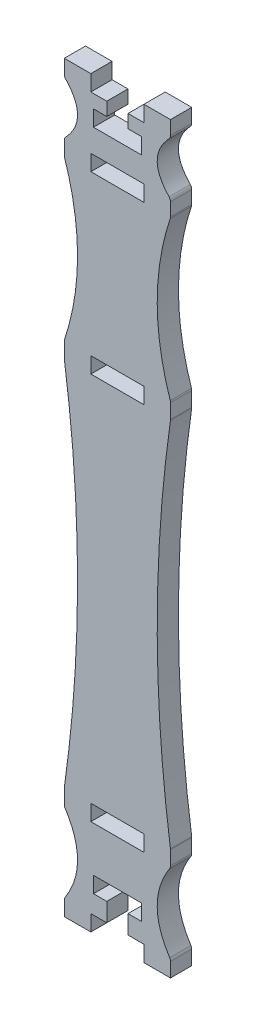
from build123d import *

# Parameters (mm, degrees)
CROQUIS1_W              = 10
CROQUIS1_H              = 3
SALIENTE_EXTRUIR1_DEPTH = 4


with BuildPart() as part:
    # Croquis1 → Saliente-Extruir1 (new body)
    with BuildSketch(Plane.XY):
        with BuildLine():
            Line((-15, -70), (-10, -70))
            Line((-10, -70), (-10, -67))
            Line((-10, -67), (-7, -67))
            Line((-7, -67), (-7, -63.5))
            Line((-7, -63.5), (-9.5, -63.5))
            Line((-9.5, -63.5), (-9.5, -60.5))
            Line((-9.5, -60.5), (-0.5, -60.5))
            Line((-0.5, -60.5), (-0.5, -63.5))
            Line((-0.5, -63.5), (-3, -63.5))
            Line((-3, -63.5), (-3, -67))
            Line((-3, -67), (0, -67))
            Line((0, -67), (0, -70))
            Line((0, -70), (5, -70))
            Line((5, -70), (5, -67.298618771))
            ThreePointArc((5, -67.298618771), (4.959256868, -67.016083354), (4.840347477, -66.756570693))
            add(Edge.make_bspline(
                [(4.840347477, -66.756570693), (3.280115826, -64.337713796), (1.719884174, -59.5), (3.280115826, -54.662286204), (4.840347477, -52.243429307)],
                knots=[0.01622862, 0.01622862, 0.01622862, 0.01622862, 0.5, 0.98377138, 0.98377138, 0.98377138, 0.98377138], degree=3))
            ThreePointArc((4.840347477, -52.243429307), (4.959256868, -51.983916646), (5, -51.701381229))
            Line((5, -51.701381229), (5, -49.070997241))
            ThreePointArc((5, -49.070997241), (4.997494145, -49.000248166), (4.989989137, -48.929853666))
            add(Edge.make_bspline(
                [(4.989989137, -48.929853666), (3.329996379, -37.286569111), (1.670003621, -14), (3.329996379, 9.286569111), (4.989989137, 20.929853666)],
                knots=[0.00100209, 0.00100209, 0.00100209, 0.00100209, 0.5, 0.99899791, 0.99899791, 0.99899791, 0.99899791], degree=3))
            ThreePointArc((4.989989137, 20.929853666), (4.997494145, 21.000248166), (5, 21.070997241))
            Line((5, 21.070997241), (5, 23.838505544))
            ThreePointArc((5, 23.838505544), (4.987329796, 23.997187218), (4.949640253, 24.151847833))
            add(Edge.make_bspline(
                [(4.949640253, 24.151847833), (3.316546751, 29.101231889), (1.683453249, 39), (3.316546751, 48.898768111), (4.949640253, 53.848152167)],
                knots=[0.005061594, 0.005061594, 0.005061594, 0.005061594, 0.5, 0.994938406, 0.994938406, 0.994938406, 0.994938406], degree=3))
            ThreePointArc((4.949640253, 53.848152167), (4.987329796, 54.002812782), (5, 54.161494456))
            Line((5, 54.161494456), (5, 56.594252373))
            ThreePointArc((5, 56.594252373), (4.929306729, 56.963561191), (4.727221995, 57.280654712))
            add(Edge.make_bspline(
                [(4.727221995, 57.280654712), (3.242407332, 58.853769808), (1.757592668, 62), (3.242407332, 65.146230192), (4.727221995, 66.719345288)],
                knots=[0.028065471, 0.028065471, 0.028065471, 0.028065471, 0.5, 0.971934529, 0.971934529, 0.971934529, 0.971934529], degree=3))
            ThreePointArc((4.727221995, 66.719345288), (4.929306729, 67.036438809), (5, 67.405747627))
            Line((5, 67.405747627), (5, 70))
            Line((5, 70), (0, 70))
            Line((0, 70), (0, 67))
            Line((0, 67), (-3, 67))
            Line((-3, 67), (-3, 64.5))
            Line((-3, 64.5), (-0.5, 64.5))
            Line((-0.5, 64.5), (-0.5, 61.5))
            Line((-0.5, 61.5), (-9.5, 61.5))
            Line((-9.5, 61.5), (-9.5, 64.5))
            Line((-9.5, 64.5), (-7, 64.5))
            Line((-7, 64.5), (-7, 67))
            Line((-7, 67), (-10, 67))
            Line((-10, 67), (-10, 70))
            Line((-10, 70), (-15, 70))
            Line((-15, 70), (-15, 67.405747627))
            ThreePointArc((-15, 67.405747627), (-14.929306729, 67.036438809), (-14.727221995, 66.719345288))
            add(Edge.make_bspline(
                [(-14.727221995, 57.280654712), (-13.242407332, 58.853769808), (-11.757592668, 62), (-13.242407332, 65.146230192), (-14.727221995, 66.719345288)],
                knots=[0.028065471, 0.028065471, 0.028065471, 0.028065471, 0.5, 0.971934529, 0.971934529, 0.971934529, 0.971934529], degree=3))
            ThreePointArc((-14.727221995, 57.280654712), (-14.929306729, 56.963561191), (-15, 56.594252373))
            Line((-15, 56.594252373), (-15, 54.161494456))
            ThreePointArc((-15, 54.161494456), (-14.987329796, 54.002812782), (-14.949640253, 53.848152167))
            add(Edge.make_bspline(
                [(-14.949640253, 24.151847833), (-13.316546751, 29.101231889), (-11.683453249, 39), (-13.316546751, 48.898768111), (-14.949640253, 53.848152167)],
                knots=[0.005061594, 0.005061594, 0.005061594, 0.005061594, 0.5, 0.994938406, 0.994938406, 0.994938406, 0.994938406], degree=3))
            ThreePointArc((-14.949640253, 24.151847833), (-14.987329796, 23.997187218), (-15, 23.838505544))
            Line((-15, 23.838505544), (-15, 21.070997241))
            ThreePointArc((-15, 21.070997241), (-14.997494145, 21.000248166), (-14.989989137, 20.929853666))
            add(Edge.make_bspline(
                [(-14.989989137, -48.929853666), (-13.329996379, -37.286569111), (-11.670003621, -14), (-13.329996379, 9.286569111), (-14.989989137, 20.929853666)],
                knots=[0.00100209, 0.00100209, 0.00100209, 0.00100209, 0.5, 0.99899791, 0.99899791, 0.99899791, 0.99899791], degree=3))
            ThreePointArc((-14.989989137, -48.929853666), (-14.997494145, -49.000248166), (-15, -49.070997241))
            Line((-15, -49.070997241), (-15, -51.701381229))
            ThreePointArc((-15, -51.701381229), (-14.959256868, -51.983916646), (-14.840347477, -52.243429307))
            add(Edge.make_bspline(
                [(-14.840347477, -66.756570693), (-13.280115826, -64.337713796), (-11.719884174, -59.5), (-13.280115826, -54.662286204), (-14.840347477, -52.243429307)],
                knots=[0.01622862, 0.01622862, 0.01622862, 0.01622862, 0.5, 0.98377138, 0.98377138, 0.98377138, 0.98377138], degree=3))
            ThreePointArc((-14.840347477, -66.756570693), (-14.959256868, -67.016083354), (-15, -67.298618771))
            Line((-15, -67.298618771), (-15, -70))
        make_face()
        with Locations((-5, -50.5)):
            Rectangle(CROQUIS1_W, CROQUIS1_H, mode=Mode.SUBTRACT)
        with Locations((-5, 22.5)):
            Rectangle(CROQUIS1_W, CROQUIS1_H, mode=Mode.SUBTRACT)
        with Locations((-5, 55.5)):
            Rectangle(CROQUIS1_W, CROQUIS1_H, mode=Mode.SUBTRACT)
    extrude(amount=SALIENTE_EXTRUIR1_DEPTH)


solid = part.part
